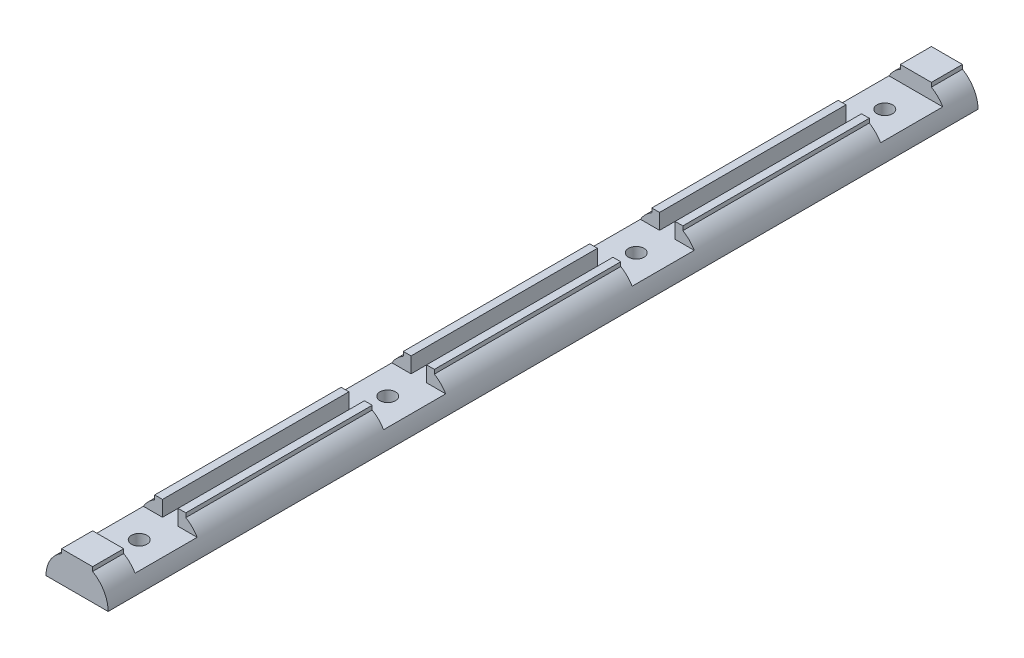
from build123d import *

# Parameters (mm, degrees)
SKETCH1_R           = 10
BOSS_EXTRUDE1_DEPTH = 140
SKETCH2_W           = 10
SKETCH2_H           = 20
BOSS_EXTRUDE2_DEPTH = 280
SKETCH3_W           = 17.320508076
SKETCH3_H           = 5
CUT_EXTRUDE1_DEPTH  = 10
SKETCH4_R           = 2.5
CUT_EXTRUDE3_DEPTH  = 142.155942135
SKETCH5_W           = 5
SKETCH5_H           = 220
CUT_EXTRUDE2_DEPTH  = 5
LPATTERN1_COUNT     = 4
LPATTERN1_PITCH     = 80
SKETCH6_W           = 20
SKETCH6_H           = 10
CUT_EXTRUDE4_DEPTH  = 281.356915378


with BuildPart() as part:
    # Sketch1 → Boss-Extrude1 (new, symmetric)
    with BuildSketch(Plane.XY):
        Circle(SKETCH1_R)
    extrude(amount=BOSS_EXTRUDE1_DEPTH, both=True)

    # Sketch2 → Boss-Extrude2 (add)
    with BuildSketch(Plane.XY.offset(140)):
        Rectangle(SKETCH2_W, SKETCH2_H)
    extrude(amount=-BOSS_EXTRUDE2_DEPTH)

    # Sketch3 → Cut-Extrude1 (cut, symmetric)
    with BuildSketch(Plane.XY.offset(-120)):
        with Locations((0, 7.5)):
            Rectangle(SKETCH3_W, SKETCH3_H)
    cut_extrude1 = extrude(amount=CUT_EXTRUDE1_DEPTH, both=True, mode=Mode.SUBTRACT)

    # Sketch4 → Cut-Extrude3 (cut, through all)
    with BuildSketch(Plane(origin=(0, 5, 0), x_dir=(1, 0, 0), z_dir=(0, 1, 0))):
        with Locations(Location((0, 120, 0), (0, 0, 270))):
            Circle(SKETCH4_R)
    cut_extrude3 = extrude(amount=-CUT_EXTRUDE3_DEPTH, mode=Mode.SUBTRACT)

    # Sketch5 → Cut-Extrude2 (cut)
    with BuildSketch(Plane(origin=(0, 10, 0), x_dir=(1, 0, 0), z_dir=(0, 1, 0))):
        Rectangle(SKETCH5_W, SKETCH5_H)
    extrude(amount=-CUT_EXTRUDE2_DEPTH, mode=Mode.SUBTRACT)

    # LPattern1: Cut-Extrude1, Cut-Extrude3 ×4
    with Locations(*[(0, 0, i * LPATTERN1_PITCH) for i in range(1, LPATTERN1_COUNT)]):
        add(cut_extrude1, mode=Mode.SUBTRACT)
        add(cut_extrude3, mode=Mode.SUBTRACT)

    # Sketch6 → Cut-Extrude4 (cut, through all)
    with BuildSketch(Plane.XY.offset(140)):
        with Locations((0, -5)):
            Rectangle(SKETCH6_W, SKETCH6_H)
    extrude(amount=-CUT_EXTRUDE4_DEPTH, mode=Mode.SUBTRACT)


solid = part.part
